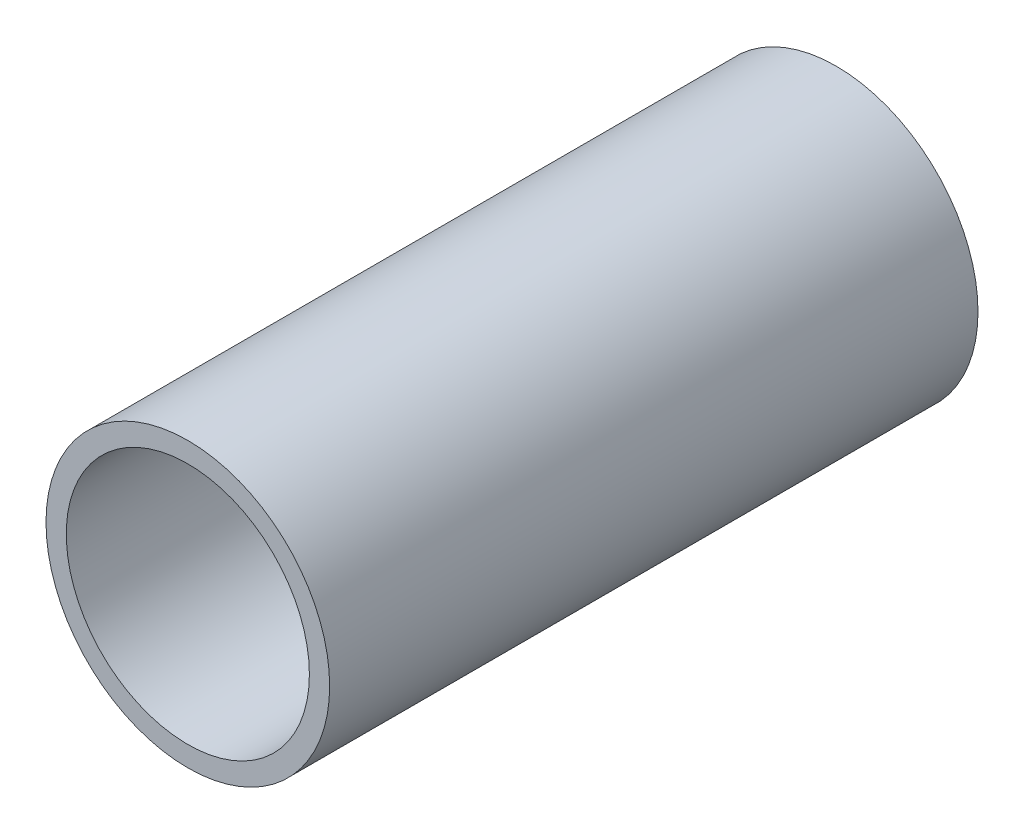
from build123d import *

# Parameters (mm, degrees)
SKETCH1_R           = 44.45
SKETCH1_R_2         = 38.1
BOSS_EXTRUDE1_DEPTH = 203.2


with BuildPart() as part:
    # Sketch1 → Boss-Extrude1 (new body)
    with BuildSketch(Plane.XY):
        Circle(SKETCH1_R)
        Circle(SKETCH1_R_2, mode=Mode.SUBTRACT)
    extrude(amount=BOSS_EXTRUDE1_DEPTH)


solid = part.part
